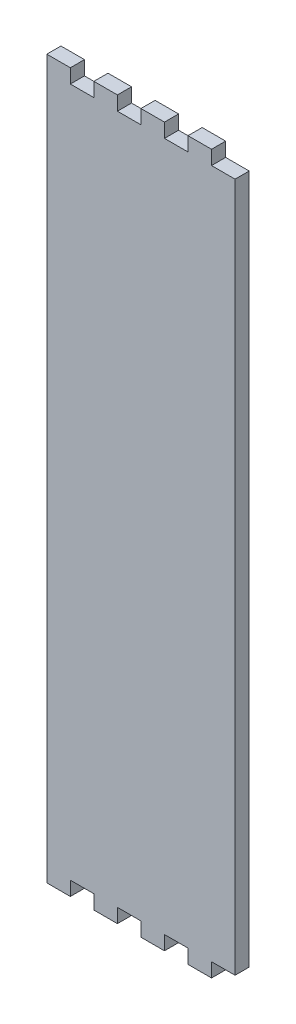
ISO-10303-21;
HEADER;
FILE_DESCRIPTION(('STEP AP214'),'2;1');
FILE_NAME('part.step','',(''),(''),'','','');
FILE_SCHEMA(('AUTOMOTIVE_DESIGN { 1 0 10303 214 1 1 1 1 }'));
ENDSEC;
DATA;
#1=APPLICATION_CONTEXT('core data for automotive mechanical design processes');
#2=APPLICATION_PROTOCOL_DEFINITION('international standard','automotive_design',2000,#1);
#3=PRODUCT_CONTEXT('',#1,'mechanical');
#4=PRODUCT('Part','Part','',(#3));
#5=PRODUCT_RELATED_PRODUCT_CATEGORY('part','',(#4));
#6=PRODUCT_DEFINITION_FORMATION('','',#4);
#7=PRODUCT_DEFINITION_CONTEXT('part definition',#1,'design');
#8=PRODUCT_DEFINITION('design','',#6,#7);
#9=PRODUCT_DEFINITION_SHAPE('','',#8);
#10=(LENGTH_UNIT() NAMED_UNIT(*) SI_UNIT(.MILLI.,.METRE.));
#11=(NAMED_UNIT(*) PLANE_ANGLE_UNIT() SI_UNIT($,.RADIAN.));
#12=(NAMED_UNIT(*) SI_UNIT($,.STERADIAN.) SOLID_ANGLE_UNIT());
#13=UNCERTAINTY_MEASURE_WITH_UNIT(LENGTH_MEASURE(1.E-05),#10,'distance_accuracy_value','');
#14=(GEOMETRIC_REPRESENTATION_CONTEXT(3) GLOBAL_UNCERTAINTY_ASSIGNED_CONTEXT((#13)) GLOBAL_UNIT_ASSIGNED_CONTEXT((#10,
#11,#12)) REPRESENTATION_CONTEXT('',''));
#15=CARTESIAN_POINT('',(0.,0.,0.));
#16=DIRECTION('',(0.,0.,1.));
#17=DIRECTION('',(1.,0.,0.));
#18=AXIS2_PLACEMENT_3D('',#15,#16,#17);
#19=CARTESIAN_POINT('',(-40.,152.5,6.));
#20=DIRECTION('',(1.,0.,0.));
#21=DIRECTION('',(0.,0.,-1.));
#22=AXIS2_PLACEMENT_3D('',#19,#20,#21);
#23=PLANE('',#22);
#24=DIRECTION('',(0.,-1.,0.));
#25=VECTOR('',#24,1.);
#26=CARTESIAN_POINT('',(-40.,152.5,0.));
#27=LINE('',#26,#25);
#28=CARTESIAN_POINT('',(-40.,152.5,0.));
#29=VERTEX_POINT('',#28);
#30=CARTESIAN_POINT('',(-40.,-152.5,0.));
#31=VERTEX_POINT('',#30);
#32=EDGE_CURVE('E274',#29,#31,#27,.T.);
#33=ORIENTED_EDGE('',*,*,#32,.T.);
#34=DIRECTION('',(0.,0.,-1.));
#35=VECTOR('',#34,1.);
#36=CARTESIAN_POINT('',(-40.,-152.5,6.));
#37=LINE('',#36,#35);
#38=CARTESIAN_POINT('',(-40.,-152.5,6.));
#39=VERTEX_POINT('',#38);
#40=EDGE_CURVE('E11',#39,#31,#37,.T.);
#41=ORIENTED_EDGE('',*,*,#40,.F.);
#42=DIRECTION('',(0.,-1.,0.));
#43=VECTOR('',#42,1.);
#44=CARTESIAN_POINT('',(-40.,152.5,6.));
#45=LINE('',#44,#43);
#46=CARTESIAN_POINT('',(-40.,152.5,6.));
#47=VERTEX_POINT('',#46);
#48=EDGE_CURVE('E336',#47,#39,#45,.T.);
#49=ORIENTED_EDGE('',*,*,#48,.F.);
#50=DIRECTION('',(0.,0.,-1.));
#51=VECTOR('',#50,1.);
#52=CARTESIAN_POINT('',(-40.,152.5,6.));
#53=LINE('',#52,#51);
#54=EDGE_CURVE('E270',#47,#29,#53,.T.);
#55=ORIENTED_EDGE('',*,*,#54,.T.);
#56=EDGE_LOOP('',(#33,#41,#49,#55));
#57=FACE_BOUND('',#56,.T.);
#58=ADVANCED_FACE('F34',(#57),#23,.F.);
#59=CARTESIAN_POINT('',(-40.,-152.5,6.));
#60=DIRECTION('',(0.,1.,0.));
#61=DIRECTION('',(0.,0.,1.));
#62=AXIS2_PLACEMENT_3D('',#59,#60,#61);
#63=PLANE('',#62);
#64=DIRECTION('',(1.,0.,0.));
#65=VECTOR('',#64,1.);
#66=CARTESIAN_POINT('',(-40.,-152.5,0.));
#67=LINE('',#66,#65);
#68=CARTESIAN_POINT('',(-30.,-152.5,0.));
#69=VERTEX_POINT('',#68);
#70=EDGE_CURVE('E277',#31,#69,#67,.T.);
#71=ORIENTED_EDGE('',*,*,#70,.T.);
#72=DIRECTION('',(0.,0.,-1.));
#73=VECTOR('',#72,1.);
#74=CARTESIAN_POINT('',(-30.,-152.5,6.));
#75=LINE('',#74,#73);
#76=CARTESIAN_POINT('',(-30.,-152.5,6.));
#77=VERTEX_POINT('',#76);
#78=EDGE_CURVE('E42',#77,#69,#75,.T.);
#79=ORIENTED_EDGE('',*,*,#78,.F.);
#80=DIRECTION('',(1.,0.,0.));
#81=VECTOR('',#80,1.);
#82=CARTESIAN_POINT('',(-40.,-152.5,6.));
#83=LINE('',#82,#81);
#84=EDGE_CURVE('E165',#39,#77,#83,.T.);
#85=ORIENTED_EDGE('',*,*,#84,.F.);
#86=ORIENTED_EDGE('',*,*,#40,.T.);
#87=EDGE_LOOP('',(#71,#79,#85,#86));
#88=FACE_BOUND('',#87,.T.);
#89=ADVANCED_FACE('F514',(#88),#63,.F.);
#90=CARTESIAN_POINT('',(-30.,-152.5,6.));
#91=DIRECTION('',(-1.,0.,0.));
#92=DIRECTION('',(0.,0.,1.));
#93=AXIS2_PLACEMENT_3D('',#90,#91,#92);
#94=PLANE('',#93);
#95=DIRECTION('',(0.,1.,0.));
#96=VECTOR('',#95,1.);
#97=CARTESIAN_POINT('',(-30.,-152.5,0.));
#98=LINE('',#97,#96);
#99=CARTESIAN_POINT('',(-30.,-146.5,0.));
#100=VERTEX_POINT('',#99);
#101=EDGE_CURVE('E279',#69,#100,#98,.T.);
#102=ORIENTED_EDGE('',*,*,#101,.T.);
#103=DIRECTION('',(0.,0.,-1.));
#104=VECTOR('',#103,1.);
#105=CARTESIAN_POINT('',(-30.,-146.5,6.));
#106=LINE('',#105,#104);
#107=CARTESIAN_POINT('',(-30.,-146.5,6.));
#108=VERTEX_POINT('',#107);
#109=EDGE_CURVE('E415',#108,#100,#106,.T.);
#110=ORIENTED_EDGE('',*,*,#109,.F.);
#111=DIRECTION('',(0.,1.,0.));
#112=VECTOR('',#111,1.);
#113=CARTESIAN_POINT('',(-30.,-152.5,6.));
#114=LINE('',#113,#112);
#115=EDGE_CURVE('E423',#77,#108,#114,.T.);
#116=ORIENTED_EDGE('',*,*,#115,.F.);
#117=ORIENTED_EDGE('',*,*,#78,.T.);
#118=EDGE_LOOP('',(#102,#110,#116,#117));
#119=FACE_BOUND('',#118,.T.);
#120=ADVANCED_FACE('F421',(#119),#94,.F.);
#121=CARTESIAN_POINT('',(-30.,-146.5,6.));
#122=DIRECTION('',(0.,1.,0.));
#123=DIRECTION('',(0.,0.,1.));
#124=AXIS2_PLACEMENT_3D('',#121,#122,#123);
#125=PLANE('',#124);
#126=DIRECTION('',(1.,0.,0.));
#127=VECTOR('',#126,1.);
#128=CARTESIAN_POINT('',(-30.,-146.5,0.));
#129=LINE('',#128,#127);
#130=CARTESIAN_POINT('',(-20.,-146.5,0.));
#131=VERTEX_POINT('',#130);
#132=EDGE_CURVE('E281',#100,#131,#129,.T.);
#133=ORIENTED_EDGE('',*,*,#132,.T.);
#134=DIRECTION('',(0.,0.,-1.));
#135=VECTOR('',#134,1.);
#136=CARTESIAN_POINT('',(-20.,-146.5,6.));
#137=LINE('',#136,#135);
#138=CARTESIAN_POINT('',(-20.,-146.5,6.));
#139=VERTEX_POINT('',#138);
#140=EDGE_CURVE('E412',#139,#131,#137,.T.);
#141=ORIENTED_EDGE('',*,*,#140,.F.);
#142=DIRECTION('',(1.,0.,0.));
#143=VECTOR('',#142,1.);
#144=CARTESIAN_POINT('',(-30.,-146.5,6.));
#145=LINE('',#144,#143);
#146=EDGE_CURVE('E441',#108,#139,#145,.T.);
#147=ORIENTED_EDGE('',*,*,#146,.F.);
#148=ORIENTED_EDGE('',*,*,#109,.T.);
#149=EDGE_LOOP('',(#133,#141,#147,#148));
#150=FACE_BOUND('',#149,.T.);
#151=ADVANCED_FACE('F432',(#150),#125,.F.);
#152=CARTESIAN_POINT('',(-20.,-152.5,6.));
#153=DIRECTION('',(1.,0.,0.));
#154=DIRECTION('',(0.,1.,0.));
#155=AXIS2_PLACEMENT_3D('',#152,#153,#154);
#156=PLANE('',#155);
#157=DIRECTION('',(0.,-1.,0.));
#158=VECTOR('',#157,1.);
#159=CARTESIAN_POINT('',(-20.,-152.5,0.));
#160=LINE('',#159,#158);
#161=CARTESIAN_POINT('',(-20.,-152.5,0.));
#162=VERTEX_POINT('',#161);
#163=EDGE_CURVE('E283',#131,#162,#160,.T.);
#164=ORIENTED_EDGE('',*,*,#163,.T.);
#165=DIRECTION('',(0.,0.,-1.));
#166=VECTOR('',#165,1.);
#167=CARTESIAN_POINT('',(-20.,-152.5,6.));
#168=LINE('',#167,#166);
#169=CARTESIAN_POINT('',(-20.,-152.5,6.));
#170=VERTEX_POINT('',#169);
#171=EDGE_CURVE('E409',#170,#162,#168,.T.);
#172=ORIENTED_EDGE('',*,*,#171,.F.);
#173=DIRECTION('',(0.,-1.,0.));
#174=VECTOR('',#173,1.);
#175=CARTESIAN_POINT('',(-20.,-152.5,6.));
#176=LINE('',#175,#174);
#177=EDGE_CURVE('E438',#139,#170,#176,.T.);
#178=ORIENTED_EDGE('',*,*,#177,.F.);
#179=ORIENTED_EDGE('',*,*,#140,.T.);
#180=EDGE_LOOP('',(#164,#172,#178,#179));
#181=FACE_BOUND('',#180,.T.);
#182=ADVANCED_FACE('F436',(#181),#156,.F.);
#183=CARTESIAN_POINT('',(-20.,-152.5,6.));
#184=DIRECTION('',(0.,1.,0.));
#185=DIRECTION('',(0.,0.,1.));
#186=AXIS2_PLACEMENT_3D('',#183,#184,#185);
#187=PLANE('',#186);
#188=DIRECTION('',(1.,0.,0.));
#189=VECTOR('',#188,1.);
#190=CARTESIAN_POINT('',(-20.,-152.5,0.));
#191=LINE('',#190,#189);
#192=CARTESIAN_POINT('',(-9.99999999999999,-152.5,0.));
#193=VERTEX_POINT('',#192);
#194=EDGE_CURVE('E285',#162,#193,#191,.T.);
#195=ORIENTED_EDGE('',*,*,#194,.T.);
#196=DIRECTION('',(0.,0.,-1.));
#197=VECTOR('',#196,1.);
#198=CARTESIAN_POINT('',(-9.99999999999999,-152.5,6.));
#199=LINE('',#198,#197);
#200=CARTESIAN_POINT('',(-9.99999999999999,-152.5,6.));
#201=VERTEX_POINT('',#200);
#202=EDGE_CURVE('E406',#201,#193,#199,.T.);
#203=ORIENTED_EDGE('',*,*,#202,.F.);
#204=DIRECTION('',(1.,0.,0.));
#205=VECTOR('',#204,1.);
#206=CARTESIAN_POINT('',(-20.,-152.5,6.));
#207=LINE('',#206,#205);
#208=EDGE_CURVE('E440',#170,#201,#207,.T.);
#209=ORIENTED_EDGE('',*,*,#208,.F.);
#210=ORIENTED_EDGE('',*,*,#171,.T.);
#211=EDGE_LOOP('',(#195,#203,#209,#210));
#212=FACE_BOUND('',#211,.T.);
#213=ADVANCED_FACE('F527',(#212),#187,.F.);
#214=CARTESIAN_POINT('',(-9.99999999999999,-152.5,6.));
#215=DIRECTION('',(-1.,0.,0.));
#216=DIRECTION('',(0.,-1.,0.));
#217=AXIS2_PLACEMENT_3D('',#214,#215,#216);
#218=PLANE('',#217);
#219=DIRECTION('',(0.,1.,0.));
#220=VECTOR('',#219,1.);
#221=CARTESIAN_POINT('',(-9.99999999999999,-152.5,0.));
#222=LINE('',#221,#220);
#223=CARTESIAN_POINT('',(-9.99999999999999,-146.5,0.));
#224=VERTEX_POINT('',#223);
#225=EDGE_CURVE('E287',#193,#224,#222,.T.);
#226=ORIENTED_EDGE('',*,*,#225,.T.);
#227=DIRECTION('',(0.,0.,-1.));
#228=VECTOR('',#227,1.);
#229=CARTESIAN_POINT('',(-9.99999999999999,-146.5,6.));
#230=LINE('',#229,#228);
#231=CARTESIAN_POINT('',(-9.99999999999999,-146.5,6.));
#232=VERTEX_POINT('',#231);
#233=EDGE_CURVE('E403',#232,#224,#230,.T.);
#234=ORIENTED_EDGE('',*,*,#233,.F.);
#235=DIRECTION('',(0.,1.,0.));
#236=VECTOR('',#235,1.);
#237=CARTESIAN_POINT('',(-9.99999999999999,-152.5,6.));
#238=LINE('',#237,#236);
#239=EDGE_CURVE('E443',#201,#232,#238,.T.);
#240=ORIENTED_EDGE('',*,*,#239,.F.);
#241=ORIENTED_EDGE('',*,*,#202,.T.);
#242=EDGE_LOOP('',(#226,#234,#240,#241));
#243=FACE_BOUND('',#242,.T.);
#244=ADVANCED_FACE('F530',(#243),#218,.F.);
#245=CARTESIAN_POINT('',(-9.99999999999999,-146.5,6.));
#246=DIRECTION('',(0.,1.,0.));
#247=DIRECTION('',(0.,0.,1.));
#248=AXIS2_PLACEMENT_3D('',#245,#246,#247);
#249=PLANE('',#248);
#250=DIRECTION('',(1.,0.,0.));
#251=VECTOR('',#250,1.);
#252=CARTESIAN_POINT('',(-9.99999999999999,-146.5,0.));
#253=LINE('',#252,#251);
#254=CARTESIAN_POINT('',(0.,-146.5,0.));
#255=VERTEX_POINT('',#254);
#256=EDGE_CURVE('E289',#224,#255,#253,.T.);
#257=ORIENTED_EDGE('',*,*,#256,.T.);
#258=DIRECTION('',(0.,0.,-1.));
#259=VECTOR('',#258,1.);
#260=CARTESIAN_POINT('',(0.,-146.5,6.));
#261=LINE('',#260,#259);
#262=CARTESIAN_POINT('',(0.,-146.5,6.));
#263=VERTEX_POINT('',#262);
#264=EDGE_CURVE('E400',#263,#255,#261,.T.);
#265=ORIENTED_EDGE('',*,*,#264,.F.);
#266=DIRECTION('',(1.,0.,0.));
#267=VECTOR('',#266,1.);
#268=CARTESIAN_POINT('',(-9.99999999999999,-146.5,6.));
#269=LINE('',#268,#267);
#270=EDGE_CURVE('E449',#232,#263,#269,.T.);
#271=ORIENTED_EDGE('',*,*,#270,.F.);
#272=ORIENTED_EDGE('',*,*,#233,.T.);
#273=EDGE_LOOP('',(#257,#265,#271,#272));
#274=FACE_BOUND('',#273,.T.);
#275=ADVANCED_FACE('F534',(#274),#249,.F.);
#276=CARTESIAN_POINT('',(0.,-152.5,6.));
#277=DIRECTION('',(1.,0.,0.));
#278=DIRECTION('',(0.,1.,0.));
#279=AXIS2_PLACEMENT_3D('',#276,#277,#278);
#280=PLANE('',#279);
#281=DIRECTION('',(0.,-1.,0.));
#282=VECTOR('',#281,1.);
#283=CARTESIAN_POINT('',(0.,-152.5,0.));
#284=LINE('',#283,#282);
#285=CARTESIAN_POINT('',(0.,-152.5,0.));
#286=VERTEX_POINT('',#285);
#287=EDGE_CURVE('E291',#255,#286,#284,.T.);
#288=ORIENTED_EDGE('',*,*,#287,.T.);
#289=DIRECTION('',(0.,0.,-1.));
#290=VECTOR('',#289,1.);
#291=CARTESIAN_POINT('',(0.,-152.5,6.));
#292=LINE('',#291,#290);
#293=CARTESIAN_POINT('',(0.,-152.5,6.));
#294=VERTEX_POINT('',#293);
#295=EDGE_CURVE('E397',#294,#286,#292,.T.);
#296=ORIENTED_EDGE('',*,*,#295,.F.);
#297=DIRECTION('',(0.,-1.,0.));
#298=VECTOR('',#297,1.);
#299=CARTESIAN_POINT('',(0.,-152.5,6.));
#300=LINE('',#299,#298);
#301=EDGE_CURVE('E451',#263,#294,#300,.T.);
#302=ORIENTED_EDGE('',*,*,#301,.F.);
#303=ORIENTED_EDGE('',*,*,#264,.T.);
#304=EDGE_LOOP('',(#288,#296,#302,#303));
#305=FACE_BOUND('',#304,.T.);
#306=ADVANCED_FACE('F538',(#305),#280,.F.);
#307=CARTESIAN_POINT('',(0.,-152.5,6.));
#308=DIRECTION('',(0.,1.,0.));
#309=DIRECTION('',(0.,0.,1.));
#310=AXIS2_PLACEMENT_3D('',#307,#308,#309);
#311=PLANE('',#310);
#312=DIRECTION('',(1.,0.,0.));
#313=VECTOR('',#312,1.);
#314=CARTESIAN_POINT('',(0.,-152.5,0.));
#315=LINE('',#314,#313);
#316=CARTESIAN_POINT('',(10.,-152.5,0.));
#317=VERTEX_POINT('',#316);
#318=EDGE_CURVE('E293',#286,#317,#315,.T.);
#319=ORIENTED_EDGE('',*,*,#318,.T.);
#320=DIRECTION('',(0.,0.,-1.));
#321=VECTOR('',#320,1.);
#322=CARTESIAN_POINT('',(10.,-152.5,6.));
#323=LINE('',#322,#321);
#324=CARTESIAN_POINT('',(10.,-152.5,6.));
#325=VERTEX_POINT('',#324);
#326=EDGE_CURVE('E394',#325,#317,#323,.T.);
#327=ORIENTED_EDGE('',*,*,#326,.F.);
#328=DIRECTION('',(1.,0.,0.));
#329=VECTOR('',#328,1.);
#330=CARTESIAN_POINT('',(0.,-152.5,6.));
#331=LINE('',#330,#329);
#332=EDGE_CURVE('E453',#294,#325,#331,.T.);
#333=ORIENTED_EDGE('',*,*,#332,.F.);
#334=ORIENTED_EDGE('',*,*,#295,.T.);
#335=EDGE_LOOP('',(#319,#327,#333,#334));
#336=FACE_BOUND('',#335,.T.);
#337=ADVANCED_FACE('F542',(#336),#311,.F.);
#338=CARTESIAN_POINT('',(10.,-152.5,6.));
#339=DIRECTION('',(-1.,0.,0.));
#340=DIRECTION('',(0.,-1.,0.));
#341=AXIS2_PLACEMENT_3D('',#338,#339,#340);
#342=PLANE('',#341);
#343=DIRECTION('',(0.,1.,0.));
#344=VECTOR('',#343,1.);
#345=CARTESIAN_POINT('',(10.,-152.5,0.));
#346=LINE('',#345,#344);
#347=CARTESIAN_POINT('',(10.,-146.5,0.));
#348=VERTEX_POINT('',#347);
#349=EDGE_CURVE('E295',#317,#348,#346,.T.);
#350=ORIENTED_EDGE('',*,*,#349,.T.);
#351=DIRECTION('',(0.,0.,-1.));
#352=VECTOR('',#351,1.);
#353=CARTESIAN_POINT('',(10.,-146.5,6.));
#354=LINE('',#353,#352);
#355=CARTESIAN_POINT('',(10.,-146.5,6.));
#356=VERTEX_POINT('',#355);
#357=EDGE_CURVE('E391',#356,#348,#354,.T.);
#358=ORIENTED_EDGE('',*,*,#357,.F.);
#359=DIRECTION('',(0.,1.,0.));
#360=VECTOR('',#359,1.);
#361=CARTESIAN_POINT('',(10.,-152.5,6.));
#362=LINE('',#361,#360);
#363=EDGE_CURVE('E455',#325,#356,#362,.T.);
#364=ORIENTED_EDGE('',*,*,#363,.F.);
#365=ORIENTED_EDGE('',*,*,#326,.T.);
#366=EDGE_LOOP('',(#350,#358,#364,#365));
#367=FACE_BOUND('',#366,.T.);
#368=ADVANCED_FACE('F546',(#367),#342,.F.);
#369=CARTESIAN_POINT('',(10.,-146.5,6.));
#370=DIRECTION('',(0.,1.,0.));
#371=DIRECTION('',(0.,0.,1.));
#372=AXIS2_PLACEMENT_3D('',#369,#370,#371);
#373=PLANE('',#372);
#374=DIRECTION('',(1.,0.,0.));
#375=VECTOR('',#374,1.);
#376=CARTESIAN_POINT('',(10.,-146.5,0.));
#377=LINE('',#376,#375);
#378=CARTESIAN_POINT('',(20.,-146.5,0.));
#379=VERTEX_POINT('',#378);
#380=EDGE_CURVE('E297',#348,#379,#377,.T.);
#381=ORIENTED_EDGE('',*,*,#380,.T.);
#382=DIRECTION('',(0.,0.,-1.));
#383=VECTOR('',#382,1.);
#384=CARTESIAN_POINT('',(20.,-146.5,6.));
#385=LINE('',#384,#383);
#386=CARTESIAN_POINT('',(20.,-146.5,6.));
#387=VERTEX_POINT('',#386);
#388=EDGE_CURVE('E388',#387,#379,#385,.T.);
#389=ORIENTED_EDGE('',*,*,#388,.F.);
#390=DIRECTION('',(1.,0.,0.));
#391=VECTOR('',#390,1.);
#392=CARTESIAN_POINT('',(10.,-146.5,6.));
#393=LINE('',#392,#391);
#394=EDGE_CURVE('E457',#356,#387,#393,.T.);
#395=ORIENTED_EDGE('',*,*,#394,.F.);
#396=ORIENTED_EDGE('',*,*,#357,.T.);
#397=EDGE_LOOP('',(#381,#389,#395,#396));
#398=FACE_BOUND('',#397,.T.);
#399=ADVANCED_FACE('F550',(#398),#373,.F.);
#400=CARTESIAN_POINT('',(20.,-152.5,6.));
#401=DIRECTION('',(1.,0.,0.));
#402=DIRECTION('',(0.,1.,0.));
#403=AXIS2_PLACEMENT_3D('',#400,#401,#402);
#404=PLANE('',#403);
#405=DIRECTION('',(0.,-1.,0.));
#406=VECTOR('',#405,1.);
#407=CARTESIAN_POINT('',(20.,-152.5,0.));
#408=LINE('',#407,#406);
#409=CARTESIAN_POINT('',(20.,-152.5,0.));
#410=VERTEX_POINT('',#409);
#411=EDGE_CURVE('E299',#379,#410,#408,.T.);
#412=ORIENTED_EDGE('',*,*,#411,.T.);
#413=DIRECTION('',(0.,0.,-1.));
#414=VECTOR('',#413,1.);
#415=CARTESIAN_POINT('',(20.,-152.5,6.));
#416=LINE('',#415,#414);
#417=CARTESIAN_POINT('',(20.,-152.5,6.));
#418=VERTEX_POINT('',#417);
#419=EDGE_CURVE('E385',#418,#410,#416,.T.);
#420=ORIENTED_EDGE('',*,*,#419,.F.);
#421=DIRECTION('',(0.,-1.,0.));
#422=VECTOR('',#421,1.);
#423=CARTESIAN_POINT('',(20.,-152.5,6.));
#424=LINE('',#423,#422);
#425=EDGE_CURVE('E459',#387,#418,#424,.T.);
#426=ORIENTED_EDGE('',*,*,#425,.F.);
#427=ORIENTED_EDGE('',*,*,#388,.T.);
#428=EDGE_LOOP('',(#412,#420,#426,#427));
#429=FACE_BOUND('',#428,.T.);
#430=ADVANCED_FACE('F554',(#429),#404,.F.);
#431=CARTESIAN_POINT('',(20.,-152.5,6.));
#432=DIRECTION('',(0.,1.,0.));
#433=DIRECTION('',(0.,0.,1.));
#434=AXIS2_PLACEMENT_3D('',#431,#432,#433);
#435=PLANE('',#434);
#436=DIRECTION('',(1.,0.,0.));
#437=VECTOR('',#436,1.);
#438=CARTESIAN_POINT('',(20.,-152.5,0.));
#439=LINE('',#438,#437);
#440=CARTESIAN_POINT('',(30.,-152.5,0.));
#441=VERTEX_POINT('',#440);
#442=EDGE_CURVE('E301',#410,#441,#439,.T.);
#443=ORIENTED_EDGE('',*,*,#442,.T.);
#444=DIRECTION('',(0.,0.,-1.));
#445=VECTOR('',#444,1.);
#446=CARTESIAN_POINT('',(30.,-152.5,6.));
#447=LINE('',#446,#445);
#448=CARTESIAN_POINT('',(30.,-152.5,6.));
#449=VERTEX_POINT('',#448);
#450=EDGE_CURVE('E382',#449,#441,#447,.T.);
#451=ORIENTED_EDGE('',*,*,#450,.F.);
#452=DIRECTION('',(1.,0.,0.));
#453=VECTOR('',#452,1.);
#454=CARTESIAN_POINT('',(20.,-152.5,6.));
#455=LINE('',#454,#453);
#456=EDGE_CURVE('E461',#418,#449,#455,.T.);
#457=ORIENTED_EDGE('',*,*,#456,.F.);
#458=ORIENTED_EDGE('',*,*,#419,.T.);
#459=EDGE_LOOP('',(#443,#451,#457,#458));
#460=FACE_BOUND('',#459,.T.);
#461=ADVANCED_FACE('F558',(#460),#435,.F.);
#462=CARTESIAN_POINT('',(30.,-152.5,6.));
#463=DIRECTION('',(-1.,0.,0.));
#464=DIRECTION('',(0.,-1.,0.));
#465=AXIS2_PLACEMENT_3D('',#462,#463,#464);
#466=PLANE('',#465);
#467=DIRECTION('',(0.,1.,0.));
#468=VECTOR('',#467,1.);
#469=CARTESIAN_POINT('',(30.,-152.5,0.));
#470=LINE('',#469,#468);
#471=CARTESIAN_POINT('',(30.,-146.5,0.));
#472=VERTEX_POINT('',#471);
#473=EDGE_CURVE('E303',#441,#472,#470,.T.);
#474=ORIENTED_EDGE('',*,*,#473,.T.);
#475=DIRECTION('',(0.,0.,-1.));
#476=VECTOR('',#475,1.);
#477=CARTESIAN_POINT('',(30.,-146.5,6.));
#478=LINE('',#477,#476);
#479=CARTESIAN_POINT('',(30.,-146.5,6.));
#480=VERTEX_POINT('',#479);
#481=EDGE_CURVE('E379',#480,#472,#478,.T.);
#482=ORIENTED_EDGE('',*,*,#481,.F.);
#483=DIRECTION('',(0.,1.,0.));
#484=VECTOR('',#483,1.);
#485=CARTESIAN_POINT('',(30.,-152.5,6.));
#486=LINE('',#485,#484);
#487=EDGE_CURVE('E463',#449,#480,#486,.T.);
#488=ORIENTED_EDGE('',*,*,#487,.F.);
#489=ORIENTED_EDGE('',*,*,#450,.T.);
#490=EDGE_LOOP('',(#474,#482,#488,#489));
#491=FACE_BOUND('',#490,.T.);
#492=ADVANCED_FACE('F562',(#491),#466,.F.);
#493=CARTESIAN_POINT('',(30.,-146.5,6.));
#494=DIRECTION('',(0.,1.,0.));
#495=DIRECTION('',(0.,0.,1.));
#496=AXIS2_PLACEMENT_3D('',#493,#494,#495);
#497=PLANE('',#496);
#498=DIRECTION('',(1.,0.,0.));
#499=VECTOR('',#498,1.);
#500=CARTESIAN_POINT('',(30.,-146.5,0.));
#501=LINE('',#500,#499);
#502=CARTESIAN_POINT('',(40.,-146.5,0.));
#503=VERTEX_POINT('',#502);
#504=EDGE_CURVE('E305',#472,#503,#501,.T.);
#505=ORIENTED_EDGE('',*,*,#504,.T.);
#506=DIRECTION('',(0.,0.,-1.));
#507=VECTOR('',#506,1.);
#508=CARTESIAN_POINT('',(40.,-146.5,6.));
#509=LINE('',#508,#507);
#510=CARTESIAN_POINT('',(40.,-146.5,6.));
#511=VERTEX_POINT('',#510);
#512=EDGE_CURVE('E376',#511,#503,#509,.T.);
#513=ORIENTED_EDGE('',*,*,#512,.F.);
#514=DIRECTION('',(1.,0.,0.));
#515=VECTOR('',#514,1.);
#516=CARTESIAN_POINT('',(30.,-146.5,6.));
#517=LINE('',#516,#515);
#518=EDGE_CURVE('E465',#480,#511,#517,.T.);
#519=ORIENTED_EDGE('',*,*,#518,.F.);
#520=ORIENTED_EDGE('',*,*,#481,.T.);
#521=EDGE_LOOP('',(#505,#513,#519,#520));
#522=FACE_BOUND('',#521,.T.);
#523=ADVANCED_FACE('F566',(#522),#497,.F.);
#524=CARTESIAN_POINT('',(40.,146.5,6.));
#525=DIRECTION('',(-1.,0.,0.));
#526=DIRECTION('',(0.,0.,1.));
#527=AXIS2_PLACEMENT_3D('',#524,#525,#526);
#528=PLANE('',#527);
#529=DIRECTION('',(0.,1.,0.));
#530=VECTOR('',#529,1.);
#531=CARTESIAN_POINT('',(40.,146.5,0.));
#532=LINE('',#531,#530);
#533=CARTESIAN_POINT('',(40.,146.5,0.));
#534=VERTEX_POINT('',#533);
#535=EDGE_CURVE('E307',#503,#534,#532,.T.);
#536=ORIENTED_EDGE('',*,*,#535,.T.);
#537=DIRECTION('',(0.,0.,-1.));
#538=VECTOR('',#537,1.);
#539=CARTESIAN_POINT('',(40.,146.5,6.));
#540=LINE('',#539,#538);
#541=CARTESIAN_POINT('',(40.,146.5,6.));
#542=VERTEX_POINT('',#541);
#543=EDGE_CURVE('E373',#542,#534,#540,.T.);
#544=ORIENTED_EDGE('',*,*,#543,.F.);
#545=DIRECTION('',(0.,1.,0.));
#546=VECTOR('',#545,1.);
#547=CARTESIAN_POINT('',(40.,146.5,6.));
#548=LINE('',#547,#546);
#549=EDGE_CURVE('E467',#511,#542,#548,.T.);
#550=ORIENTED_EDGE('',*,*,#549,.F.);
#551=ORIENTED_EDGE('',*,*,#512,.T.);
#552=EDGE_LOOP('',(#536,#544,#550,#551));
#553=FACE_BOUND('',#552,.T.);
#554=ADVANCED_FACE('F570',(#553),#528,.F.);
#555=CARTESIAN_POINT('',(30.,146.5,6.));
#556=DIRECTION('',(0.,-1.,0.));
#557=DIRECTION('',(0.,0.,-1.));
#558=AXIS2_PLACEMENT_3D('',#555,#556,#557);
#559=PLANE('',#558);
#560=DIRECTION('',(-1.,0.,0.));
#561=VECTOR('',#560,1.);
#562=CARTESIAN_POINT('',(30.,146.5,0.));
#563=LINE('',#562,#561);
#564=CARTESIAN_POINT('',(30.,146.5,0.));
#565=VERTEX_POINT('',#564);
#566=EDGE_CURVE('E309',#534,#565,#563,.T.);
#567=ORIENTED_EDGE('',*,*,#566,.T.);
#568=DIRECTION('',(0.,0.,-1.));
#569=VECTOR('',#568,1.);
#570=CARTESIAN_POINT('',(30.,146.5,6.));
#571=LINE('',#570,#569);
#572=CARTESIAN_POINT('',(30.,146.5,6.));
#573=VERTEX_POINT('',#572);
#574=EDGE_CURVE('E370',#573,#565,#571,.T.);
#575=ORIENTED_EDGE('',*,*,#574,.F.);
#576=DIRECTION('',(-1.,0.,0.));
#577=VECTOR('',#576,1.);
#578=CARTESIAN_POINT('',(30.,146.5,6.));
#579=LINE('',#578,#577);
#580=EDGE_CURVE('E469',#542,#573,#579,.T.);
#581=ORIENTED_EDGE('',*,*,#580,.F.);
#582=ORIENTED_EDGE('',*,*,#543,.T.);
#583=EDGE_LOOP('',(#567,#575,#581,#582));
#584=FACE_BOUND('',#583,.T.);
#585=ADVANCED_FACE('F574',(#584),#559,.F.);
#586=CARTESIAN_POINT('',(30.,152.5,6.));
#587=DIRECTION('',(-1.,0.,0.));
#588=DIRECTION('',(0.,-1.,0.));
#589=AXIS2_PLACEMENT_3D('',#586,#587,#588);
#590=PLANE('',#589);
#591=DIRECTION('',(0.,1.,0.));
#592=VECTOR('',#591,1.);
#593=CARTESIAN_POINT('',(30.,152.5,0.));
#594=LINE('',#593,#592);
#595=CARTESIAN_POINT('',(30.,152.5,0.));
#596=VERTEX_POINT('',#595);
#597=EDGE_CURVE('E311',#565,#596,#594,.T.);
#598=ORIENTED_EDGE('',*,*,#597,.T.);
#599=DIRECTION('',(0.,0.,-1.));
#600=VECTOR('',#599,1.);
#601=CARTESIAN_POINT('',(30.,152.5,6.));
#602=LINE('',#601,#600);
#603=CARTESIAN_POINT('',(30.,152.5,6.));
#604=VERTEX_POINT('',#603);
#605=EDGE_CURVE('E367',#604,#596,#602,.T.);
#606=ORIENTED_EDGE('',*,*,#605,.F.);
#607=DIRECTION('',(0.,1.,0.));
#608=VECTOR('',#607,1.);
#609=CARTESIAN_POINT('',(30.,152.5,6.));
#610=LINE('',#609,#608);
#611=EDGE_CURVE('E471',#573,#604,#610,.T.);
#612=ORIENTED_EDGE('',*,*,#611,.F.);
#613=ORIENTED_EDGE('',*,*,#574,.T.);
#614=EDGE_LOOP('',(#598,#606,#612,#613));
#615=FACE_BOUND('',#614,.T.);
#616=ADVANCED_FACE('F578',(#615),#590,.F.);
#617=CARTESIAN_POINT('',(20.,152.5,6.));
#618=DIRECTION('',(0.,-1.,0.));
#619=DIRECTION('',(0.,0.,-1.));
#620=AXIS2_PLACEMENT_3D('',#617,#618,#619);
#621=PLANE('',#620);
#622=DIRECTION('',(-1.,0.,0.));
#623=VECTOR('',#622,1.);
#624=CARTESIAN_POINT('',(20.,152.5,0.));
#625=LINE('',#624,#623);
#626=CARTESIAN_POINT('',(20.,152.5,0.));
#627=VERTEX_POINT('',#626);
#628=EDGE_CURVE('E313',#596,#627,#625,.T.);
#629=ORIENTED_EDGE('',*,*,#628,.T.);
#630=DIRECTION('',(0.,0.,-1.));
#631=VECTOR('',#630,1.);
#632=CARTESIAN_POINT('',(20.,152.5,6.));
#633=LINE('',#632,#631);
#634=CARTESIAN_POINT('',(20.,152.5,6.));
#635=VERTEX_POINT('',#634);
#636=EDGE_CURVE('E364',#635,#627,#633,.T.);
#637=ORIENTED_EDGE('',*,*,#636,.F.);
#638=DIRECTION('',(-1.,0.,0.));
#639=VECTOR('',#638,1.);
#640=CARTESIAN_POINT('',(20.,152.5,6.));
#641=LINE('',#640,#639);
#642=EDGE_CURVE('E473',#604,#635,#641,.T.);
#643=ORIENTED_EDGE('',*,*,#642,.F.);
#644=ORIENTED_EDGE('',*,*,#605,.T.);
#645=EDGE_LOOP('',(#629,#637,#643,#644));
#646=FACE_BOUND('',#645,.T.);
#647=ADVANCED_FACE('F582',(#646),#621,.F.);
#648=CARTESIAN_POINT('',(20.,152.5,6.));
#649=DIRECTION('',(1.,0.,0.));
#650=DIRECTION('',(0.,1.,0.));
#651=AXIS2_PLACEMENT_3D('',#648,#649,#650);
#652=PLANE('',#651);
#653=DIRECTION('',(0.,-1.,0.));
#654=VECTOR('',#653,1.);
#655=CARTESIAN_POINT('',(20.,152.5,0.));
#656=LINE('',#655,#654);
#657=CARTESIAN_POINT('',(20.,146.5,0.));
#658=VERTEX_POINT('',#657);
#659=EDGE_CURVE('E315',#627,#658,#656,.T.);
#660=ORIENTED_EDGE('',*,*,#659,.T.);
#661=DIRECTION('',(0.,0.,-1.));
#662=VECTOR('',#661,1.);
#663=CARTESIAN_POINT('',(20.,146.5,6.));
#664=LINE('',#663,#662);
#665=CARTESIAN_POINT('',(20.,146.5,6.));
#666=VERTEX_POINT('',#665);
#667=EDGE_CURVE('E361',#666,#658,#664,.T.);
#668=ORIENTED_EDGE('',*,*,#667,.F.);
#669=DIRECTION('',(0.,-1.,0.));
#670=VECTOR('',#669,1.);
#671=CARTESIAN_POINT('',(20.,152.5,6.));
#672=LINE('',#671,#670);
#673=EDGE_CURVE('E475',#635,#666,#672,.T.);
#674=ORIENTED_EDGE('',*,*,#673,.F.);
#675=ORIENTED_EDGE('',*,*,#636,.T.);
#676=EDGE_LOOP('',(#660,#668,#674,#675));
#677=FACE_BOUND('',#676,.T.);
#678=ADVANCED_FACE('F586',(#677),#652,.F.);
#679=CARTESIAN_POINT('',(10.,146.5,6.));
#680=DIRECTION('',(0.,-1.,0.));
#681=DIRECTION('',(0.,0.,-1.));
#682=AXIS2_PLACEMENT_3D('',#679,#680,#681);
#683=PLANE('',#682);
#684=DIRECTION('',(-1.,0.,0.));
#685=VECTOR('',#684,1.);
#686=CARTESIAN_POINT('',(10.,146.5,0.));
#687=LINE('',#686,#685);
#688=CARTESIAN_POINT('',(10.,146.5,0.));
#689=VERTEX_POINT('',#688);
#690=EDGE_CURVE('E317',#658,#689,#687,.T.);
#691=ORIENTED_EDGE('',*,*,#690,.T.);
#692=DIRECTION('',(0.,0.,-1.));
#693=VECTOR('',#692,1.);
#694=CARTESIAN_POINT('',(10.,146.5,6.));
#695=LINE('',#694,#693);
#696=CARTESIAN_POINT('',(10.,146.5,6.));
#697=VERTEX_POINT('',#696);
#698=EDGE_CURVE('E358',#697,#689,#695,.T.);
#699=ORIENTED_EDGE('',*,*,#698,.F.);
#700=DIRECTION('',(-1.,0.,0.));
#701=VECTOR('',#700,1.);
#702=CARTESIAN_POINT('',(10.,146.5,6.));
#703=LINE('',#702,#701);
#704=EDGE_CURVE('E477',#666,#697,#703,.T.);
#705=ORIENTED_EDGE('',*,*,#704,.F.);
#706=ORIENTED_EDGE('',*,*,#667,.T.);
#707=EDGE_LOOP('',(#691,#699,#705,#706));
#708=FACE_BOUND('',#707,.T.);
#709=ADVANCED_FACE('F590',(#708),#683,.F.);
#710=CARTESIAN_POINT('',(10.,152.5,6.));
#711=DIRECTION('',(-1.,0.,0.));
#712=DIRECTION('',(0.,-1.,0.));
#713=AXIS2_PLACEMENT_3D('',#710,#711,#712);
#714=PLANE('',#713);
#715=DIRECTION('',(0.,1.,0.));
#716=VECTOR('',#715,1.);
#717=CARTESIAN_POINT('',(10.,152.5,0.));
#718=LINE('',#717,#716);
#719=CARTESIAN_POINT('',(10.,152.5,0.));
#720=VERTEX_POINT('',#719);
#721=EDGE_CURVE('E319',#689,#720,#718,.T.);
#722=ORIENTED_EDGE('',*,*,#721,.T.);
#723=DIRECTION('',(0.,0.,-1.));
#724=VECTOR('',#723,1.);
#725=CARTESIAN_POINT('',(10.,152.5,6.));
#726=LINE('',#725,#724);
#727=CARTESIAN_POINT('',(10.,152.5,6.));
#728=VERTEX_POINT('',#727);
#729=EDGE_CURVE('E355',#728,#720,#726,.T.);
#730=ORIENTED_EDGE('',*,*,#729,.F.);
#731=DIRECTION('',(0.,1.,0.));
#732=VECTOR('',#731,1.);
#733=CARTESIAN_POINT('',(10.,152.5,6.));
#734=LINE('',#733,#732);
#735=EDGE_CURVE('E479',#697,#728,#734,.T.);
#736=ORIENTED_EDGE('',*,*,#735,.F.);
#737=ORIENTED_EDGE('',*,*,#698,.T.);
#738=EDGE_LOOP('',(#722,#730,#736,#737));
#739=FACE_BOUND('',#738,.T.);
#740=ADVANCED_FACE('F594',(#739),#714,.F.);
#741=CARTESIAN_POINT('',(0.,152.5,6.));
#742=DIRECTION('',(0.,-1.,0.));
#743=DIRECTION('',(0.,0.,-1.));
#744=AXIS2_PLACEMENT_3D('',#741,#742,#743);
#745=PLANE('',#744);
#746=DIRECTION('',(-1.,0.,0.));
#747=VECTOR('',#746,1.);
#748=CARTESIAN_POINT('',(0.,152.5,0.));
#749=LINE('',#748,#747);
#750=CARTESIAN_POINT('',(0.,152.5,0.));
#751=VERTEX_POINT('',#750);
#752=EDGE_CURVE('E321',#720,#751,#749,.T.);
#753=ORIENTED_EDGE('',*,*,#752,.T.);
#754=DIRECTION('',(0.,0.,-1.));
#755=VECTOR('',#754,1.);
#756=CARTESIAN_POINT('',(0.,152.5,6.));
#757=LINE('',#756,#755);
#758=CARTESIAN_POINT('',(0.,152.5,6.));
#759=VERTEX_POINT('',#758);
#760=EDGE_CURVE('E352',#759,#751,#757,.T.);
#761=ORIENTED_EDGE('',*,*,#760,.F.);
#762=DIRECTION('',(-1.,0.,0.));
#763=VECTOR('',#762,1.);
#764=CARTESIAN_POINT('',(0.,152.5,6.));
#765=LINE('',#764,#763);
#766=EDGE_CURVE('E481',#728,#759,#765,.T.);
#767=ORIENTED_EDGE('',*,*,#766,.F.);
#768=ORIENTED_EDGE('',*,*,#729,.T.);
#769=EDGE_LOOP('',(#753,#761,#767,#768));
#770=FACE_BOUND('',#769,.T.);
#771=ADVANCED_FACE('F598',(#770),#745,.F.);
#772=CARTESIAN_POINT('',(0.,152.5,6.));
#773=DIRECTION('',(1.,0.,0.));
#774=DIRECTION('',(0.,1.,0.));
#775=AXIS2_PLACEMENT_3D('',#772,#773,#774);
#776=PLANE('',#775);
#777=DIRECTION('',(0.,-1.,0.));
#778=VECTOR('',#777,1.);
#779=CARTESIAN_POINT('',(0.,152.5,0.));
#780=LINE('',#779,#778);
#781=CARTESIAN_POINT('',(0.,146.5,0.));
#782=VERTEX_POINT('',#781);
#783=EDGE_CURVE('E323',#751,#782,#780,.T.);
#784=ORIENTED_EDGE('',*,*,#783,.T.);
#785=DIRECTION('',(0.,0.,-1.));
#786=VECTOR('',#785,1.);
#787=CARTESIAN_POINT('',(0.,146.5,6.));
#788=LINE('',#787,#786);
#789=CARTESIAN_POINT('',(0.,146.5,6.));
#790=VERTEX_POINT('',#789);
#791=EDGE_CURVE('E349',#790,#782,#788,.T.);
#792=ORIENTED_EDGE('',*,*,#791,.F.);
#793=DIRECTION('',(0.,-1.,0.));
#794=VECTOR('',#793,1.);
#795=CARTESIAN_POINT('',(0.,152.5,6.));
#796=LINE('',#795,#794);
#797=EDGE_CURVE('E483',#759,#790,#796,.T.);
#798=ORIENTED_EDGE('',*,*,#797,.F.);
#799=ORIENTED_EDGE('',*,*,#760,.T.);
#800=EDGE_LOOP('',(#784,#792,#798,#799));
#801=FACE_BOUND('',#800,.T.);
#802=ADVANCED_FACE('F602',(#801),#776,.F.);
#803=CARTESIAN_POINT('',(-9.99999999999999,146.5,6.));
#804=DIRECTION('',(0.,-1.,0.));
#805=DIRECTION('',(0.,0.,-1.));
#806=AXIS2_PLACEMENT_3D('',#803,#804,#805);
#807=PLANE('',#806);
#808=DIRECTION('',(-1.,0.,0.));
#809=VECTOR('',#808,1.);
#810=CARTESIAN_POINT('',(-9.99999999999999,146.5,0.));
#811=LINE('',#810,#809);
#812=CARTESIAN_POINT('',(-9.99999999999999,146.5,0.));
#813=VERTEX_POINT('',#812);
#814=EDGE_CURVE('E325',#782,#813,#811,.T.);
#815=ORIENTED_EDGE('',*,*,#814,.T.);
#816=DIRECTION('',(0.,0.,-1.));
#817=VECTOR('',#816,1.);
#818=CARTESIAN_POINT('',(-9.99999999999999,146.5,6.));
#819=LINE('',#818,#817);
#820=CARTESIAN_POINT('',(-9.99999999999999,146.5,6.));
#821=VERTEX_POINT('',#820);
#822=EDGE_CURVE('E346',#821,#813,#819,.T.);
#823=ORIENTED_EDGE('',*,*,#822,.F.);
#824=DIRECTION('',(-1.,0.,0.));
#825=VECTOR('',#824,1.);
#826=CARTESIAN_POINT('',(-9.99999999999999,146.5,6.));
#827=LINE('',#826,#825);
#828=EDGE_CURVE('E485',#790,#821,#827,.T.);
#829=ORIENTED_EDGE('',*,*,#828,.F.);
#830=ORIENTED_EDGE('',*,*,#791,.T.);
#831=EDGE_LOOP('',(#815,#823,#829,#830));
#832=FACE_BOUND('',#831,.T.);
#833=ADVANCED_FACE('F606',(#832),#807,.F.);
#834=CARTESIAN_POINT('',(-9.99999999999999,152.5,6.));
#835=DIRECTION('',(-1.,0.,0.));
#836=DIRECTION('',(0.,-1.,0.));
#837=AXIS2_PLACEMENT_3D('',#834,#835,#836);
#838=PLANE('',#837);
#839=DIRECTION('',(0.,1.,0.));
#840=VECTOR('',#839,1.);
#841=CARTESIAN_POINT('',(-9.99999999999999,152.5,0.));
#842=LINE('',#841,#840);
#843=CARTESIAN_POINT('',(-9.99999999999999,152.5,0.));
#844=VERTEX_POINT('',#843);
#845=EDGE_CURVE('E327',#813,#844,#842,.T.);
#846=ORIENTED_EDGE('',*,*,#845,.T.);
#847=DIRECTION('',(0.,0.,-1.));
#848=VECTOR('',#847,1.);
#849=CARTESIAN_POINT('',(-9.99999999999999,152.5,6.));
#850=LINE('',#849,#848);
#851=CARTESIAN_POINT('',(-9.99999999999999,152.5,6.));
#852=VERTEX_POINT('',#851);
#853=EDGE_CURVE('E343',#852,#844,#850,.T.);
#854=ORIENTED_EDGE('',*,*,#853,.F.);
#855=DIRECTION('',(0.,1.,0.));
#856=VECTOR('',#855,1.);
#857=CARTESIAN_POINT('',(-9.99999999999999,152.5,6.));
#858=LINE('',#857,#856);
#859=EDGE_CURVE('E487',#821,#852,#858,.T.);
#860=ORIENTED_EDGE('',*,*,#859,.F.);
#861=ORIENTED_EDGE('',*,*,#822,.T.);
#862=EDGE_LOOP('',(#846,#854,#860,#861));
#863=FACE_BOUND('',#862,.T.);
#864=ADVANCED_FACE('F610',(#863),#838,.F.);
#865=CARTESIAN_POINT('',(-20.,152.5,6.));
#866=DIRECTION('',(0.,-1.,0.));
#867=DIRECTION('',(0.,0.,-1.));
#868=AXIS2_PLACEMENT_3D('',#865,#866,#867);
#869=PLANE('',#868);
#870=DIRECTION('',(-1.,0.,0.));
#871=VECTOR('',#870,1.);
#872=CARTESIAN_POINT('',(-20.,152.5,0.));
#873=LINE('',#872,#871);
#874=CARTESIAN_POINT('',(-20.,152.5,0.));
#875=VERTEX_POINT('',#874);
#876=EDGE_CURVE('E329',#844,#875,#873,.T.);
#877=ORIENTED_EDGE('',*,*,#876,.T.);
#878=DIRECTION('',(0.,0.,-1.));
#879=VECTOR('',#878,1.);
#880=CARTESIAN_POINT('',(-20.,152.5,6.));
#881=LINE('',#880,#879);
#882=CARTESIAN_POINT('',(-20.,152.5,6.));
#883=VERTEX_POINT('',#882);
#884=EDGE_CURVE('E340',#883,#875,#881,.T.);
#885=ORIENTED_EDGE('',*,*,#884,.F.);
#886=DIRECTION('',(-1.,0.,0.));
#887=VECTOR('',#886,1.);
#888=CARTESIAN_POINT('',(-20.,152.5,6.));
#889=LINE('',#888,#887);
#890=EDGE_CURVE('E489',#852,#883,#889,.T.);
#891=ORIENTED_EDGE('',*,*,#890,.F.);
#892=ORIENTED_EDGE('',*,*,#853,.T.);
#893=EDGE_LOOP('',(#877,#885,#891,#892));
#894=FACE_BOUND('',#893,.T.);
#895=ADVANCED_FACE('F495',(#894),#869,.F.);
#896=CARTESIAN_POINT('',(-20.,152.5,6.));
#897=DIRECTION('',(1.,0.,0.));
#898=DIRECTION('',(0.,1.,0.));
#899=AXIS2_PLACEMENT_3D('',#896,#897,#898);
#900=PLANE('',#899);
#901=DIRECTION('',(0.,-1.,0.));
#902=VECTOR('',#901,1.);
#903=CARTESIAN_POINT('',(-20.,152.5,0.));
#904=LINE('',#903,#902);
#905=CARTESIAN_POINT('',(-20.,146.5,0.));
#906=VERTEX_POINT('',#905);
#907=EDGE_CURVE('E331',#875,#906,#904,.T.);
#908=ORIENTED_EDGE('',*,*,#907,.T.);
#909=DIRECTION('',(0.,0.,-1.));
#910=VECTOR('',#909,1.);
#911=CARTESIAN_POINT('',(-20.,146.5,6.));
#912=LINE('',#911,#910);
#913=CARTESIAN_POINT('',(-20.,146.5,6.));
#914=VERTEX_POINT('',#913);
#915=EDGE_CURVE('E265',#914,#906,#912,.T.);
#916=ORIENTED_EDGE('',*,*,#915,.F.);
#917=DIRECTION('',(0.,-1.,0.));
#918=VECTOR('',#917,1.);
#919=CARTESIAN_POINT('',(-20.,152.5,6.));
#920=LINE('',#919,#918);
#921=EDGE_CURVE('E256',#883,#914,#920,.T.);
#922=ORIENTED_EDGE('',*,*,#921,.F.);
#923=ORIENTED_EDGE('',*,*,#884,.T.);
#924=EDGE_LOOP('',(#908,#916,#922,#923));
#925=FACE_BOUND('',#924,.T.);
#926=ADVANCED_FACE('F499',(#925),#900,.F.);
#927=CARTESIAN_POINT('',(-30.,146.5,6.));
#928=DIRECTION('',(0.,-1.,0.));
#929=DIRECTION('',(0.,0.,-1.));
#930=AXIS2_PLACEMENT_3D('',#927,#928,#929);
#931=PLANE('',#930);
#932=DIRECTION('',(-1.,0.,0.));
#933=VECTOR('',#932,1.);
#934=CARTESIAN_POINT('',(-30.,146.5,0.));
#935=LINE('',#934,#933);
#936=CARTESIAN_POINT('',(-30.,146.5,0.));
#937=VERTEX_POINT('',#936);
#938=EDGE_CURVE('E264',#906,#937,#935,.T.);
#939=ORIENTED_EDGE('',*,*,#938,.T.);
#940=DIRECTION('',(0.,0.,-1.));
#941=VECTOR('',#940,1.);
#942=CARTESIAN_POINT('',(-30.,146.5,6.));
#943=LINE('',#942,#941);
#944=CARTESIAN_POINT('',(-30.,146.5,6.));
#945=VERTEX_POINT('',#944);
#946=EDGE_CURVE('E261',#945,#937,#943,.T.);
#947=ORIENTED_EDGE('',*,*,#946,.F.);
#948=DIRECTION('',(-1.,0.,0.));
#949=VECTOR('',#948,1.);
#950=CARTESIAN_POINT('',(-30.,146.5,6.));
#951=LINE('',#950,#949);
#952=EDGE_CURVE('E250',#914,#945,#951,.T.);
#953=ORIENTED_EDGE('',*,*,#952,.F.);
#954=ORIENTED_EDGE('',*,*,#915,.T.);
#955=EDGE_LOOP('',(#939,#947,#953,#954));
#956=FACE_BOUND('',#955,.T.);
#957=ADVANCED_FACE('F262',(#956),#931,.F.);
#958=CARTESIAN_POINT('',(-30.,152.5,6.));
#959=DIRECTION('',(-1.,0.,0.));
#960=DIRECTION('',(0.,0.,1.));
#961=AXIS2_PLACEMENT_3D('',#958,#959,#960);
#962=PLANE('',#961);
#963=DIRECTION('',(0.,1.,0.));
#964=VECTOR('',#963,1.);
#965=CARTESIAN_POINT('',(-30.,152.5,0.));
#966=LINE('',#965,#964);
#967=CARTESIAN_POINT('',(-30.,152.5,0.));
#968=VERTEX_POINT('',#967);
#969=EDGE_CURVE('E151',#937,#968,#966,.T.);
#970=ORIENTED_EDGE('',*,*,#969,.T.);
#971=DIRECTION('',(0.,0.,-1.));
#972=VECTOR('',#971,1.);
#973=CARTESIAN_POINT('',(-30.,152.5,6.));
#974=LINE('',#973,#972);
#975=CARTESIAN_POINT('',(-30.,152.5,6.));
#976=VERTEX_POINT('',#975);
#977=EDGE_CURVE('E266',#976,#968,#974,.T.);
#978=ORIENTED_EDGE('',*,*,#977,.F.);
#979=DIRECTION('',(0.,1.,0.));
#980=VECTOR('',#979,1.);
#981=CARTESIAN_POINT('',(-30.,152.5,6.));
#982=LINE('',#981,#980);
#983=EDGE_CURVE('E254',#945,#976,#982,.T.);
#984=ORIENTED_EDGE('',*,*,#983,.F.);
#985=ORIENTED_EDGE('',*,*,#946,.T.);
#986=EDGE_LOOP('',(#970,#978,#984,#985));
#987=FACE_BOUND('',#986,.T.);
#988=ADVANCED_FACE('F268',(#987),#962,.F.);
#989=CARTESIAN_POINT('',(-40.,152.5,6.));
#990=DIRECTION('',(0.,-1.,0.));
#991=DIRECTION('',(0.,0.,-1.));
#992=AXIS2_PLACEMENT_3D('',#989,#990,#991);
#993=PLANE('',#992);
#994=DIRECTION('',(-1.,0.,0.));
#995=VECTOR('',#994,1.);
#996=CARTESIAN_POINT('',(-40.,152.5,0.));
#997=LINE('',#996,#995);
#998=EDGE_CURVE('E157',#968,#29,#997,.T.);
#999=ORIENTED_EDGE('',*,*,#998,.T.);
#1000=ORIENTED_EDGE('',*,*,#54,.F.);
#1001=DIRECTION('',(-1.,0.,0.));
#1002=VECTOR('',#1001,1.);
#1003=CARTESIAN_POINT('',(-40.,152.5,6.));
#1004=LINE('',#1003,#1002);
#1005=EDGE_CURVE('E50',#976,#47,#1004,.T.);
#1006=ORIENTED_EDGE('',*,*,#1005,.F.);
#1007=ORIENTED_EDGE('',*,*,#977,.T.);
#1008=EDGE_LOOP('',(#999,#1000,#1006,#1007));
#1009=FACE_BOUND('',#1008,.T.);
#1010=ADVANCED_FACE('F503',(#1009),#993,.F.);
#1011=CARTESIAN_POINT('',(0.,0.,6.));
#1012=DIRECTION('',(0.,0.,1.));
#1013=DIRECTION('',(1.,0.,0.));
#1014=AXIS2_PLACEMENT_3D('',#1011,#1012,#1013);
#1015=PLANE('',#1014);
#1016=ORIENTED_EDGE('',*,*,#48,.T.);
#1017=ORIENTED_EDGE('',*,*,#84,.T.);
#1018=ORIENTED_EDGE('',*,*,#115,.T.);
#1019=ORIENTED_EDGE('',*,*,#146,.T.);
#1020=ORIENTED_EDGE('',*,*,#177,.T.);
#1021=ORIENTED_EDGE('',*,*,#208,.T.);
#1022=ORIENTED_EDGE('',*,*,#239,.T.);
#1023=ORIENTED_EDGE('',*,*,#270,.T.);
#1024=ORIENTED_EDGE('',*,*,#301,.T.);
#1025=ORIENTED_EDGE('',*,*,#332,.T.);
#1026=ORIENTED_EDGE('',*,*,#363,.T.);
#1027=ORIENTED_EDGE('',*,*,#394,.T.);
#1028=ORIENTED_EDGE('',*,*,#425,.T.);
#1029=ORIENTED_EDGE('',*,*,#456,.T.);
#1030=ORIENTED_EDGE('',*,*,#487,.T.);
#1031=ORIENTED_EDGE('',*,*,#518,.T.);
#1032=ORIENTED_EDGE('',*,*,#549,.T.);
#1033=ORIENTED_EDGE('',*,*,#580,.T.);
#1034=ORIENTED_EDGE('',*,*,#611,.T.);
#1035=ORIENTED_EDGE('',*,*,#642,.T.);
#1036=ORIENTED_EDGE('',*,*,#673,.T.);
#1037=ORIENTED_EDGE('',*,*,#704,.T.);
#1038=ORIENTED_EDGE('',*,*,#735,.T.);
#1039=ORIENTED_EDGE('',*,*,#766,.T.);
#1040=ORIENTED_EDGE('',*,*,#797,.T.);
#1041=ORIENTED_EDGE('',*,*,#828,.T.);
#1042=ORIENTED_EDGE('',*,*,#859,.T.);
#1043=ORIENTED_EDGE('',*,*,#890,.T.);
#1044=ORIENTED_EDGE('',*,*,#921,.T.);
#1045=ORIENTED_EDGE('',*,*,#952,.T.);
#1046=ORIENTED_EDGE('',*,*,#983,.T.);
#1047=ORIENTED_EDGE('',*,*,#1005,.T.);
#1048=EDGE_LOOP('',(#1016,#1017,#1018,#1019,#1020,#1021,#1022,#1023,#1024,#1025,#1026,#1027,
#1028,#1029,#1030,#1031,#1032,#1033,#1034,#1035,#1036,#1037,#1038,#1039,#1040,#1041,#1042,#1043,
#1044,#1045,#1046,#1047));
#1049=FACE_BOUND('',#1048,.T.);
#1050=ADVANCED_FACE('F252',(#1049),#1015,.T.);
#1051=CARTESIAN_POINT('',(0.,0.,0.));
#1052=DIRECTION('',(0.,0.,1.));
#1053=DIRECTION('',(1.,0.,0.));
#1054=AXIS2_PLACEMENT_3D('',#1051,#1052,#1053);
#1055=PLANE('',#1054);
#1056=ORIENTED_EDGE('',*,*,#32,.F.);
#1057=ORIENTED_EDGE('',*,*,#998,.F.);
#1058=ORIENTED_EDGE('',*,*,#969,.F.);
#1059=ORIENTED_EDGE('',*,*,#938,.F.);
#1060=ORIENTED_EDGE('',*,*,#907,.F.);
#1061=ORIENTED_EDGE('',*,*,#876,.F.);
#1062=ORIENTED_EDGE('',*,*,#845,.F.);
#1063=ORIENTED_EDGE('',*,*,#814,.F.);
#1064=ORIENTED_EDGE('',*,*,#783,.F.);
#1065=ORIENTED_EDGE('',*,*,#752,.F.);
#1066=ORIENTED_EDGE('',*,*,#721,.F.);
#1067=ORIENTED_EDGE('',*,*,#690,.F.);
#1068=ORIENTED_EDGE('',*,*,#659,.F.);
#1069=ORIENTED_EDGE('',*,*,#628,.F.);
#1070=ORIENTED_EDGE('',*,*,#597,.F.);
#1071=ORIENTED_EDGE('',*,*,#566,.F.);
#1072=ORIENTED_EDGE('',*,*,#535,.F.);
#1073=ORIENTED_EDGE('',*,*,#504,.F.);
#1074=ORIENTED_EDGE('',*,*,#473,.F.);
#1075=ORIENTED_EDGE('',*,*,#442,.F.);
#1076=ORIENTED_EDGE('',*,*,#411,.F.);
#1077=ORIENTED_EDGE('',*,*,#380,.F.);
#1078=ORIENTED_EDGE('',*,*,#349,.F.);
#1079=ORIENTED_EDGE('',*,*,#318,.F.);
#1080=ORIENTED_EDGE('',*,*,#287,.F.);
#1081=ORIENTED_EDGE('',*,*,#256,.F.);
#1082=ORIENTED_EDGE('',*,*,#225,.F.);
#1083=ORIENTED_EDGE('',*,*,#194,.F.);
#1084=ORIENTED_EDGE('',*,*,#163,.F.);
#1085=ORIENTED_EDGE('',*,*,#132,.F.);
#1086=ORIENTED_EDGE('',*,*,#101,.F.);
#1087=ORIENTED_EDGE('',*,*,#70,.F.);
#1088=EDGE_LOOP('',(#1056,#1057,#1058,#1059,#1060,#1061,#1062,#1063,#1064,#1065,#1066,#1067,
#1068,#1069,#1070,#1071,#1072,#1073,#1074,#1075,#1076,#1077,#1078,#1079,#1080,#1081,#1082,#1083,
#1084,#1085,#1086,#1087));
#1089=FACE_BOUND('',#1088,.T.);
#1090=ADVANCED_FACE('F427',(#1089),#1055,.F.);
#1091=CLOSED_SHELL('',(#58,#89,#120,#151,#182,#213,#244,#275,#306,#337,#368,#399,#430,#461,#492,
#523,#554,#585,#616,#647,#678,#709,#740,#771,#802,#833,#864,#895,#926,#957,#988,#1010,#1050,#1090));
#1092=MANIFOLD_SOLID_BREP('B2',#1091);
#1093=ADVANCED_BREP_SHAPE_REPRESENTATION('',(#18,#1092),#14);
#1094=SHAPE_DEFINITION_REPRESENTATION(#9,#1093);
ENDSEC;
END-ISO-10303-21;
